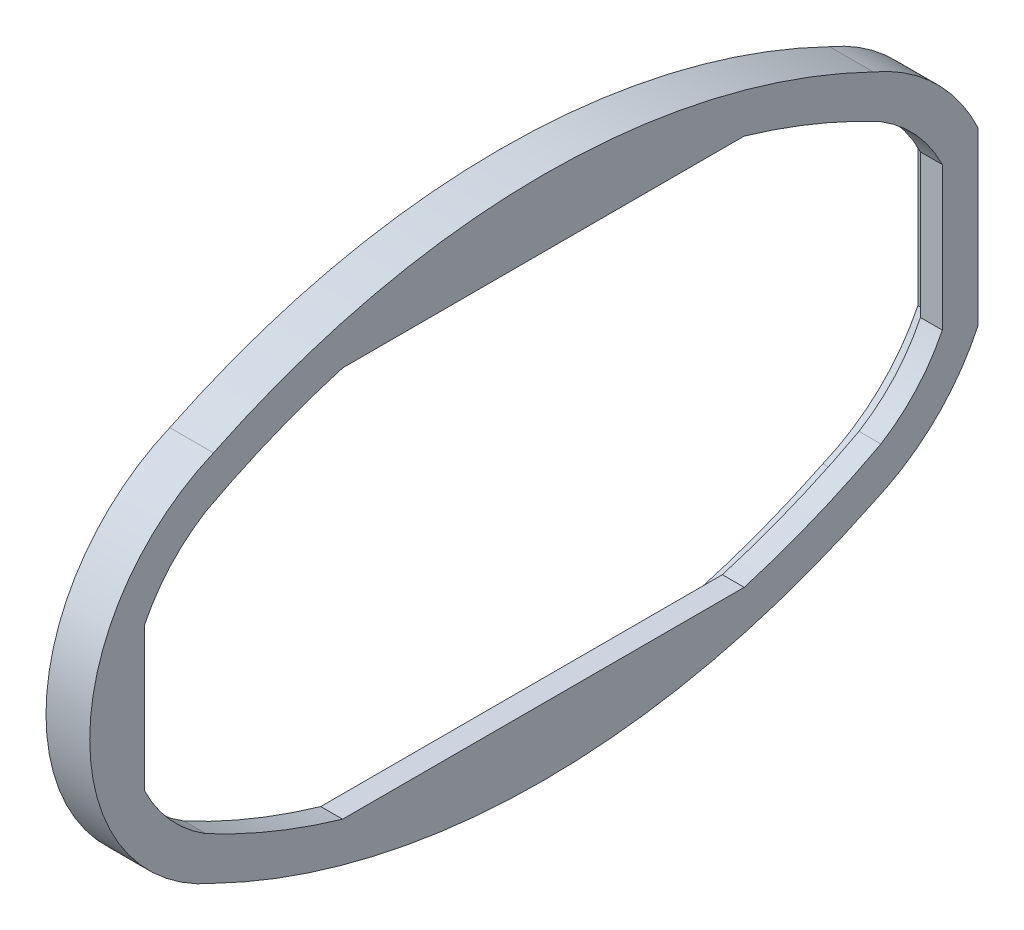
ISO-10303-21;
HEADER;
FILE_DESCRIPTION(('STEP AP214'),'2;1');
FILE_NAME('part.step','',(''),(''),'','','');
FILE_SCHEMA(('AUTOMOTIVE_DESIGN { 1 0 10303 214 1 1 1 1 }'));
ENDSEC;
DATA;
#1=APPLICATION_CONTEXT('core data for automotive mechanical design processes');
#2=APPLICATION_PROTOCOL_DEFINITION('international standard','automotive_design',2000,#1);
#3=PRODUCT_CONTEXT('',#1,'mechanical');
#4=PRODUCT('Part','Part','',(#3));
#5=PRODUCT_RELATED_PRODUCT_CATEGORY('part','',(#4));
#6=PRODUCT_DEFINITION_FORMATION('','',#4);
#7=PRODUCT_DEFINITION_CONTEXT('part definition',#1,'design');
#8=PRODUCT_DEFINITION('design','',#6,#7);
#9=PRODUCT_DEFINITION_SHAPE('','',#8);
#10=(LENGTH_UNIT() NAMED_UNIT(*) SI_UNIT(.MILLI.,.METRE.));
#11=(NAMED_UNIT(*) PLANE_ANGLE_UNIT() SI_UNIT($,.RADIAN.));
#12=(NAMED_UNIT(*) SI_UNIT($,.STERADIAN.) SOLID_ANGLE_UNIT());
#13=UNCERTAINTY_MEASURE_WITH_UNIT(LENGTH_MEASURE(1.E-05),#10,'distance_accuracy_value','');
#14=(GEOMETRIC_REPRESENTATION_CONTEXT(3) GLOBAL_UNCERTAINTY_ASSIGNED_CONTEXT((#13)) GLOBAL_UNIT_ASSIGNED_CONTEXT((#10,
#11,#12)) REPRESENTATION_CONTEXT('',''));
#15=CARTESIAN_POINT('',(0.,0.,0.));
#16=DIRECTION('',(0.,0.,1.));
#17=DIRECTION('',(1.,0.,0.));
#18=AXIS2_PLACEMENT_3D('',#15,#16,#17);
#19=CARTESIAN_POINT('',(0.,45.,0.));
#20=DIRECTION('',(-1.,0.,0.));
#21=DIRECTION('',(0.,0.,1.));
#22=AXIS2_PLACEMENT_3D('',#19,#20,#21);
#23=PLANE('',#22);
#24=CARTESIAN_POINT('',(0.,45.,0.));
#25=DIRECTION('',(1.,0.,0.));
#26=DIRECTION('',(0.,0.,-1.));
#27=AXIS2_PLACEMENT_3D('',#24,#25,#26);
#28=CIRCLE('',#27,69.);
#29=CARTESIAN_POINT('',(0.,-17.0507428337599,30.1778944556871));
#30=VERTEX_POINT('',#29);
#31=CARTESIAN_POINT('',(0.,-17.0507428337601,-30.1778944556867));
#32=VERTEX_POINT('',#31);
#33=EDGE_CURVE('E50',#30,#32,#28,.T.);
#34=ORIENTED_EDGE('',*,*,#33,.F.);
#35=CARTESIAN_POINT('',(0.,0.,23.));
#36=DIRECTION('',(1.,0.,0.));
#37=DIRECTION('',(0.,0.,1.));
#38=AXIS2_PLACEMENT_3D('',#35,#36,#37);
#39=CIRCLE('',#38,18.5);
#40=CARTESIAN_POINT('',(0.,17.0507428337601,30.1778944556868));
#41=VERTEX_POINT('',#40);
#42=EDGE_CURVE('E374',#41,#30,#39,.T.);
#43=ORIENTED_EDGE('',*,*,#42,.F.);
#44=CARTESIAN_POINT('',(0.,-45.,0.));
#45=DIRECTION('',(1.,0.,0.));
#46=DIRECTION('',(0.,0.,-1.));
#47=AXIS2_PLACEMENT_3D('',#44,#45,#46);
#48=CIRCLE('',#47,69.);
#49=CARTESIAN_POINT('',(0.,17.0507428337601,-30.1778944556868));
#50=VERTEX_POINT('',#49);
#51=EDGE_CURVE('E372',#50,#41,#48,.T.);
#52=ORIENTED_EDGE('',*,*,#51,.F.);
#53=CARTESIAN_POINT('',(0.,0.,-23.));
#54=DIRECTION('',(1.,0.,0.));
#55=DIRECTION('',(0.,0.,-1.));
#56=AXIS2_PLACEMENT_3D('',#53,#54,#55);
#57=CIRCLE('',#56,18.5);
#58=CARTESIAN_POINT('',(0.,7.84101786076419,-39.7561463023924));
#59=VERTEX_POINT('',#58);
#60=EDGE_CURVE('E369',#59,#50,#57,.T.);
#61=ORIENTED_EDGE('',*,*,#60,.F.);
#62=DIRECTION('',(0.,1.,0.));
#63=VECTOR('',#62,1.);
#64=CARTESIAN_POINT('',(0.,7.84101786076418,-39.7561463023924));
#65=LINE('',#64,#63);
#66=CARTESIAN_POINT('',(0.,-7.84101786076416,-39.7561463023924));
#67=VERTEX_POINT('',#66);
#68=EDGE_CURVE('E367',#67,#59,#65,.T.);
#69=ORIENTED_EDGE('',*,*,#68,.F.);
#70=CARTESIAN_POINT('',(0.,0.,-23.));
#71=DIRECTION('',(1.,0.,0.));
#72=DIRECTION('',(0.,0.,-1.));
#73=AXIS2_PLACEMENT_3D('',#70,#71,#72);
#74=CIRCLE('',#73,18.5);
#75=EDGE_CURVE('E365',#32,#67,#74,.T.);
#76=ORIENTED_EDGE('',*,*,#75,.F.);
#77=EDGE_LOOP('',(#34,#43,#52,#61,#69,#76));
#78=FACE_BOUND('',#77,.T.);
#79=CARTESIAN_POINT('',(0.,-45.,0.));
#80=DIRECTION('',(1.,0.,0.));
#81=DIRECTION('',(0.,0.,-1.));
#82=AXIS2_PLACEMENT_3D('',#79,#80,#81);
#83=CIRCLE('',#82,67.5);
#84=CARTESIAN_POINT('',(0.,15.6837381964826,-29.5589904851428));
#85=VERTEX_POINT('',#84);
#86=CARTESIAN_POINT('',(0.,15.6837381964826,29.5589904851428));
#87=VERTEX_POINT('',#86);
#88=EDGE_CURVE('E330',#85,#87,#83,.T.);
#89=ORIENTED_EDGE('',*,*,#88,.T.);
#90=CARTESIAN_POINT('',(0.,0.,23.));
#91=DIRECTION('',(1.,0.,0.));
#92=DIRECTION('',(0.,0.,1.));
#93=AXIS2_PLACEMENT_3D('',#90,#91,#92);
#94=CIRCLE('',#93,17.);
#95=CARTESIAN_POINT('',(0.,-15.6837381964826,29.5589904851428));
#96=VERTEX_POINT('',#95);
#97=EDGE_CURVE('E42',#87,#96,#94,.T.);
#98=ORIENTED_EDGE('',*,*,#97,.T.);
#99=CARTESIAN_POINT('',(0.,45.,0.));
#100=DIRECTION('',(1.,0.,0.));
#101=DIRECTION('',(0.,0.,-1.));
#102=AXIS2_PLACEMENT_3D('',#99,#100,#101);
#103=CIRCLE('',#102,67.5);
#104=CARTESIAN_POINT('',(0.,-15.6837381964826,-29.5589904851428));
#105=VERTEX_POINT('',#104);
#106=EDGE_CURVE('E318',#96,#105,#103,.T.);
#107=ORIENTED_EDGE('',*,*,#106,.T.);
#108=CARTESIAN_POINT('',(0.,0.,-23.));
#109=DIRECTION('',(1.,0.,0.));
#110=DIRECTION('',(0.,0.,-1.));
#111=AXIS2_PLACEMENT_3D('',#108,#109,#110);
#112=CIRCLE('',#111,17.);
#113=CARTESIAN_POINT('',(0.,-7.5,-38.2561463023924));
#114=VERTEX_POINT('',#113);
#115=EDGE_CURVE('E321',#105,#114,#112,.T.);
#116=ORIENTED_EDGE('',*,*,#115,.T.);
#117=DIRECTION('',(0.,1.,0.));
#118=VECTOR('',#117,1.);
#119=CARTESIAN_POINT('',(0.,7.5,-38.2561463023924));
#120=LINE('',#119,#118);
#121=CARTESIAN_POINT('',(0.,7.5,-38.2561463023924));
#122=VERTEX_POINT('',#121);
#123=EDGE_CURVE('E324',#114,#122,#120,.T.);
#124=ORIENTED_EDGE('',*,*,#123,.T.);
#125=CARTESIAN_POINT('',(0.,0.,-23.));
#126=DIRECTION('',(1.,0.,0.));
#127=DIRECTION('',(0.,0.,-1.));
#128=AXIS2_PLACEMENT_3D('',#125,#126,#127);
#129=CIRCLE('',#128,17.);
#130=EDGE_CURVE('E327',#122,#85,#129,.T.);
#131=ORIENTED_EDGE('',*,*,#130,.T.);
#132=EDGE_LOOP('',(#89,#98,#107,#116,#124,#131));
#133=FACE_BOUND('',#132,.T.);
#134=ADVANCED_FACE('F27',(#78,#133),#23,.T.);
#135=CARTESIAN_POINT('',(2.,45.,0.));
#136=DIRECTION('',(-1.,0.,0.));
#137=DIRECTION('',(0.,0.,1.));
#138=AXIS2_PLACEMENT_3D('',#135,#136,#137);
#139=CYLINDRICAL_SURFACE('',#138,69.);
#140=ORIENTED_EDGE('',*,*,#33,.T.);
#141=DIRECTION('',(-1.,0.,0.));
#142=VECTOR('',#141,1.);
#143=CARTESIAN_POINT('',(2.,-17.0507428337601,-30.1778944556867));
#144=LINE('',#143,#142);
#145=CARTESIAN_POINT('',(4.,-17.0507428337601,-30.1778944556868));
#146=VERTEX_POINT('',#145);
#147=EDGE_CURVE('E11',#146,#32,#144,.T.);
#148=ORIENTED_EDGE('',*,*,#147,.F.);
#149=CARTESIAN_POINT('',(4.,45.0000000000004,0.));
#150=DIRECTION('',(1.,0.,0.));
#151=DIRECTION('',(0.,0.,-1.));
#152=AXIS2_PLACEMENT_3D('',#149,#150,#151);
#153=CIRCLE('',#152,69.0000000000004);
#154=CARTESIAN_POINT('',(4.,-17.0507428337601,30.1778944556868));
#155=VERTEX_POINT('',#154);
#156=EDGE_CURVE('E302',#155,#146,#153,.T.);
#157=ORIENTED_EDGE('',*,*,#156,.F.);
#158=DIRECTION('',(-1.,0.,0.));
#159=VECTOR('',#158,1.);
#160=CARTESIAN_POINT('',(2.,-17.0507428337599,30.1778944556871));
#161=LINE('',#160,#159);
#162=EDGE_CURVE('E376',#155,#30,#161,.T.);
#163=ORIENTED_EDGE('',*,*,#162,.T.);
#164=EDGE_LOOP('',(#140,#148,#157,#163));
#165=FACE_BOUND('',#164,.T.);
#166=ADVANCED_FACE('F29',(#165),#139,.T.);
#167=CARTESIAN_POINT('',(2.,0.,-23.));
#168=DIRECTION('',(-1.,0.,0.));
#169=DIRECTION('',(0.,0.,1.));
#170=AXIS2_PLACEMENT_3D('',#167,#168,#169);
#171=CYLINDRICAL_SURFACE('',#170,18.5);
#172=ORIENTED_EDGE('',*,*,#75,.T.);
#173=DIRECTION('',(-1.,0.,0.));
#174=VECTOR('',#173,1.);
#175=CARTESIAN_POINT('',(2.,-7.84101786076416,-39.7561463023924));
#176=LINE('',#175,#174);
#177=CARTESIAN_POINT('',(4.,-7.84101786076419,-39.7561463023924));
#178=VERTEX_POINT('',#177);
#179=EDGE_CURVE('E35',#178,#67,#176,.T.);
#180=ORIENTED_EDGE('',*,*,#179,.F.);
#181=CARTESIAN_POINT('',(4.,0.,-23.0000000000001));
#182=DIRECTION('',(1.,0.,0.));
#183=DIRECTION('',(0.,0.,-1.));
#184=AXIS2_PLACEMENT_3D('',#181,#182,#183);
#185=CIRCLE('',#184,18.5);
#186=EDGE_CURVE('E305',#146,#178,#185,.T.);
#187=ORIENTED_EDGE('',*,*,#186,.F.);
#188=ORIENTED_EDGE('',*,*,#147,.T.);
#189=EDGE_LOOP('',(#172,#180,#187,#188));
#190=FACE_BOUND('',#189,.T.);
#191=ADVANCED_FACE('F407',(#190),#171,.T.);
#192=CARTESIAN_POINT('',(2.,7.84101786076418,-39.7561463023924));
#193=DIRECTION('',(0.,0.,1.));
#194=DIRECTION('',(1.,0.,0.));
#195=AXIS2_PLACEMENT_3D('',#192,#193,#194);
#196=PLANE('',#195);
#197=ORIENTED_EDGE('',*,*,#68,.T.);
#198=DIRECTION('',(-1.,0.,0.));
#199=VECTOR('',#198,1.);
#200=CARTESIAN_POINT('',(2.,7.84101786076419,-39.7561463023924));
#201=LINE('',#200,#199);
#202=CARTESIAN_POINT('',(4.,7.84101786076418,-39.7561463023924));
#203=VERTEX_POINT('',#202);
#204=EDGE_CURVE('E385',#203,#59,#201,.T.);
#205=ORIENTED_EDGE('',*,*,#204,.F.);
#206=DIRECTION('',(0.,1.,0.));
#207=VECTOR('',#206,1.);
#208=CARTESIAN_POINT('',(4.,7.84101786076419,-39.7561463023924));
#209=LINE('',#208,#207);
#210=EDGE_CURVE('E308',#178,#203,#209,.T.);
#211=ORIENTED_EDGE('',*,*,#210,.F.);
#212=ORIENTED_EDGE('',*,*,#179,.T.);
#213=EDGE_LOOP('',(#197,#205,#211,#212));
#214=FACE_BOUND('',#213,.T.);
#215=ADVANCED_FACE('F391',(#214),#196,.F.);
#216=CARTESIAN_POINT('',(2.,0.,-23.));
#217=DIRECTION('',(-1.,0.,0.));
#218=DIRECTION('',(0.,0.,1.));
#219=AXIS2_PLACEMENT_3D('',#216,#217,#218);
#220=CYLINDRICAL_SURFACE('',#219,18.5);
#221=ORIENTED_EDGE('',*,*,#60,.T.);
#222=DIRECTION('',(-1.,0.,0.));
#223=VECTOR('',#222,1.);
#224=CARTESIAN_POINT('',(2.,17.0507428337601,-30.1778944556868));
#225=LINE('',#224,#223);
#226=CARTESIAN_POINT('',(4.,17.0507428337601,-30.1778944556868));
#227=VERTEX_POINT('',#226);
#228=EDGE_CURVE('E382',#227,#50,#225,.T.);
#229=ORIENTED_EDGE('',*,*,#228,.F.);
#230=CARTESIAN_POINT('',(4.,0.,-23.0000000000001));
#231=DIRECTION('',(1.,0.,0.));
#232=DIRECTION('',(0.,0.,1.));
#233=AXIS2_PLACEMENT_3D('',#230,#231,#232);
#234=CIRCLE('',#233,18.4999999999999);
#235=EDGE_CURVE('E311',#203,#227,#234,.T.);
#236=ORIENTED_EDGE('',*,*,#235,.F.);
#237=ORIENTED_EDGE('',*,*,#204,.T.);
#238=EDGE_LOOP('',(#221,#229,#236,#237));
#239=FACE_BOUND('',#238,.T.);
#240=ADVANCED_FACE('F397',(#239),#220,.T.);
#241=CARTESIAN_POINT('',(2.,-45.,0.));
#242=DIRECTION('',(-1.,0.,0.));
#243=DIRECTION('',(0.,0.,1.));
#244=AXIS2_PLACEMENT_3D('',#241,#242,#243);
#245=CYLINDRICAL_SURFACE('',#244,69.);
#246=ORIENTED_EDGE('',*,*,#51,.T.);
#247=DIRECTION('',(-1.,0.,0.));
#248=VECTOR('',#247,1.);
#249=CARTESIAN_POINT('',(2.,17.0507428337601,30.1778944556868));
#250=LINE('',#249,#248);
#251=CARTESIAN_POINT('',(4.,17.0507428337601,30.1778944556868));
#252=VERTEX_POINT('',#251);
#253=EDGE_CURVE('E379',#252,#41,#250,.T.);
#254=ORIENTED_EDGE('',*,*,#253,.F.);
#255=CARTESIAN_POINT('',(4.,-45.0000000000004,0.));
#256=DIRECTION('',(1.,0.,0.));
#257=DIRECTION('',(0.,0.,1.));
#258=AXIS2_PLACEMENT_3D('',#255,#256,#257);
#259=CIRCLE('',#258,69.0000000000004);
#260=EDGE_CURVE('E314',#227,#252,#259,.T.);
#261=ORIENTED_EDGE('',*,*,#260,.F.);
#262=ORIENTED_EDGE('',*,*,#228,.T.);
#263=EDGE_LOOP('',(#246,#254,#261,#262));
#264=FACE_BOUND('',#263,.T.);
#265=ADVANCED_FACE('F401',(#264),#245,.T.);
#266=CARTESIAN_POINT('',(2.,0.,23.));
#267=DIRECTION('',(-1.,0.,0.));
#268=DIRECTION('',(0.,0.,1.));
#269=AXIS2_PLACEMENT_3D('',#266,#267,#268);
#270=CYLINDRICAL_SURFACE('',#269,18.5);
#271=ORIENTED_EDGE('',*,*,#42,.T.);
#272=ORIENTED_EDGE('',*,*,#162,.F.);
#273=CARTESIAN_POINT('',(4.,0.,22.9999999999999));
#274=DIRECTION('',(1.,0.,0.));
#275=DIRECTION('',(0.,0.,-1.));
#276=AXIS2_PLACEMENT_3D('',#273,#274,#275);
#277=CIRCLE('',#276,18.5);
#278=EDGE_CURVE('E299',#252,#155,#277,.T.);
#279=ORIENTED_EDGE('',*,*,#278,.F.);
#280=ORIENTED_EDGE('',*,*,#253,.T.);
#281=EDGE_LOOP('',(#271,#272,#279,#280));
#282=FACE_BOUND('',#281,.T.);
#283=ADVANCED_FACE('F404',(#282),#270,.T.);
#284=CARTESIAN_POINT('',(2.,0.,23.));
#285=DIRECTION('',(-1.,0.,0.));
#286=DIRECTION('',(0.,0.,1.));
#287=AXIS2_PLACEMENT_3D('',#284,#285,#286);
#288=CYLINDRICAL_SURFACE('',#287,17.);
#289=ORIENTED_EDGE('',*,*,#97,.F.);
#290=DIRECTION('',(-1.,0.,0.));
#291=VECTOR('',#290,1.);
#292=CARTESIAN_POINT('',(2.,15.6837381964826,29.5589904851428));
#293=LINE('',#292,#291);
#294=CARTESIAN_POINT('',(2.,15.6837381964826,29.5589904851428));
#295=VERTEX_POINT('',#294);
#296=EDGE_CURVE('E351',#295,#87,#293,.T.);
#297=ORIENTED_EDGE('',*,*,#296,.F.);
#298=CARTESIAN_POINT('',(2.,0.,23.));
#299=DIRECTION('',(1.,0.,0.));
#300=DIRECTION('',(0.,0.,1.));
#301=AXIS2_PLACEMENT_3D('',#298,#299,#300);
#302=CIRCLE('',#301,17.);
#303=CARTESIAN_POINT('',(2.,-15.6837381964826,29.5589904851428));
#304=VERTEX_POINT('',#303);
#305=EDGE_CURVE('E333',#295,#304,#302,.T.);
#306=ORIENTED_EDGE('',*,*,#305,.T.);
#307=DIRECTION('',(-1.,0.,0.));
#308=VECTOR('',#307,1.);
#309=CARTESIAN_POINT('',(2.,-15.6837381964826,29.5589904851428));
#310=LINE('',#309,#308);
#311=EDGE_CURVE('E362',#304,#96,#310,.T.);
#312=ORIENTED_EDGE('',*,*,#311,.T.);
#313=EDGE_LOOP('',(#289,#297,#306,#312));
#314=FACE_BOUND('',#313,.T.);
#315=ADVANCED_FACE('F420',(#314),#288,.F.);
#316=CARTESIAN_POINT('',(2.,45.,0.));
#317=DIRECTION('',(-1.,0.,0.));
#318=DIRECTION('',(0.,0.,1.));
#319=AXIS2_PLACEMENT_3D('',#316,#317,#318);
#320=CYLINDRICAL_SURFACE('',#319,67.5);
#321=ORIENTED_EDGE('',*,*,#106,.F.);
#322=ORIENTED_EDGE('',*,*,#311,.F.);
#323=CARTESIAN_POINT('',(2.,45.,0.));
#324=DIRECTION('',(1.,0.,0.));
#325=DIRECTION('',(0.,0.,1.));
#326=AXIS2_PLACEMENT_3D('',#323,#324,#325);
#327=CIRCLE('',#326,67.5);
#328=CARTESIAN_POINT('',(2.,-15.6837381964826,-29.5589904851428));
#329=VERTEX_POINT('',#328);
#330=EDGE_CURVE('E336',#304,#329,#327,.T.);
#331=ORIENTED_EDGE('',*,*,#330,.T.);
#332=DIRECTION('',(-1.,0.,0.));
#333=VECTOR('',#332,1.);
#334=CARTESIAN_POINT('',(2.,-15.6837381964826,-29.5589904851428));
#335=LINE('',#334,#333);
#336=EDGE_CURVE('E360',#329,#105,#335,.T.);
#337=ORIENTED_EDGE('',*,*,#336,.T.);
#338=EDGE_LOOP('',(#321,#322,#331,#337));
#339=FACE_BOUND('',#338,.T.);
#340=ADVANCED_FACE('F449',(#339),#320,.F.);
#341=CARTESIAN_POINT('',(2.,0.,-23.));
#342=DIRECTION('',(-1.,0.,0.));
#343=DIRECTION('',(0.,0.,1.));
#344=AXIS2_PLACEMENT_3D('',#341,#342,#343);
#345=CYLINDRICAL_SURFACE('',#344,17.);
#346=ORIENTED_EDGE('',*,*,#115,.F.);
#347=ORIENTED_EDGE('',*,*,#336,.F.);
#348=CARTESIAN_POINT('',(2.,0.,-23.));
#349=DIRECTION('',(1.,0.,0.));
#350=DIRECTION('',(0.,0.,-1.));
#351=AXIS2_PLACEMENT_3D('',#348,#349,#350);
#352=CIRCLE('',#351,17.);
#353=CARTESIAN_POINT('',(2.,-7.5,-38.2561463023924));
#354=VERTEX_POINT('',#353);
#355=EDGE_CURVE('E339',#329,#354,#352,.T.);
#356=ORIENTED_EDGE('',*,*,#355,.T.);
#357=DIRECTION('',(-1.,0.,0.));
#358=VECTOR('',#357,1.);
#359=CARTESIAN_POINT('',(2.,-7.5,-38.2561463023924));
#360=LINE('',#359,#358);
#361=EDGE_CURVE('E358',#354,#114,#360,.T.);
#362=ORIENTED_EDGE('',*,*,#361,.T.);
#363=EDGE_LOOP('',(#346,#347,#356,#362));
#364=FACE_BOUND('',#363,.T.);
#365=ADVANCED_FACE('F456',(#364),#345,.F.);
#366=CARTESIAN_POINT('',(2.,7.5,-38.2561463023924));
#367=DIRECTION('',(0.,0.,1.));
#368=DIRECTION('',(1.,0.,0.));
#369=AXIS2_PLACEMENT_3D('',#366,#367,#368);
#370=PLANE('',#369);
#371=ORIENTED_EDGE('',*,*,#123,.F.);
#372=ORIENTED_EDGE('',*,*,#361,.F.);
#373=DIRECTION('',(0.,1.,0.));
#374=VECTOR('',#373,1.);
#375=CARTESIAN_POINT('',(2.,7.5,-38.2561463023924));
#376=LINE('',#375,#374);
#377=CARTESIAN_POINT('',(2.,7.5,-38.2561463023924));
#378=VERTEX_POINT('',#377);
#379=EDGE_CURVE('E342',#354,#378,#376,.T.);
#380=ORIENTED_EDGE('',*,*,#379,.T.);
#381=DIRECTION('',(-1.,0.,0.));
#382=VECTOR('',#381,1.);
#383=CARTESIAN_POINT('',(2.,7.5,-38.2561463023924));
#384=LINE('',#383,#382);
#385=EDGE_CURVE('E356',#378,#122,#384,.T.);
#386=ORIENTED_EDGE('',*,*,#385,.T.);
#387=EDGE_LOOP('',(#371,#372,#380,#386));
#388=FACE_BOUND('',#387,.T.);
#389=ADVANCED_FACE('F463',(#388),#370,.T.);
#390=CARTESIAN_POINT('',(2.,0.,-23.));
#391=DIRECTION('',(-1.,0.,0.));
#392=DIRECTION('',(0.,0.,1.));
#393=AXIS2_PLACEMENT_3D('',#390,#391,#392);
#394=CYLINDRICAL_SURFACE('',#393,17.);
#395=ORIENTED_EDGE('',*,*,#130,.F.);
#396=ORIENTED_EDGE('',*,*,#385,.F.);
#397=CARTESIAN_POINT('',(2.,0.,-23.));
#398=DIRECTION('',(1.,0.,0.));
#399=DIRECTION('',(0.,0.,-1.));
#400=AXIS2_PLACEMENT_3D('',#397,#398,#399);
#401=CIRCLE('',#400,17.);
#402=CARTESIAN_POINT('',(2.,15.6837381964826,-29.5589904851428));
#403=VERTEX_POINT('',#402);
#404=EDGE_CURVE('E345',#378,#403,#401,.T.);
#405=ORIENTED_EDGE('',*,*,#404,.T.);
#406=DIRECTION('',(-1.,0.,0.));
#407=VECTOR('',#406,1.);
#408=CARTESIAN_POINT('',(2.,15.6837381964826,-29.5589904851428));
#409=LINE('',#408,#407);
#410=EDGE_CURVE('E353',#403,#85,#409,.T.);
#411=ORIENTED_EDGE('',*,*,#410,.T.);
#412=EDGE_LOOP('',(#395,#396,#405,#411));
#413=FACE_BOUND('',#412,.T.);
#414=ADVANCED_FACE('F471',(#413),#394,.F.);
#415=CARTESIAN_POINT('',(2.,-45.,0.));
#416=DIRECTION('',(-1.,0.,0.));
#417=DIRECTION('',(0.,0.,1.));
#418=AXIS2_PLACEMENT_3D('',#415,#416,#417);
#419=CYLINDRICAL_SURFACE('',#418,67.5);
#420=ORIENTED_EDGE('',*,*,#88,.F.);
#421=ORIENTED_EDGE('',*,*,#410,.F.);
#422=CARTESIAN_POINT('',(2.,-45.,0.));
#423=DIRECTION('',(1.,0.,0.));
#424=DIRECTION('',(0.,0.,1.));
#425=AXIS2_PLACEMENT_3D('',#422,#423,#424);
#426=CIRCLE('',#425,67.5);
#427=EDGE_CURVE('E348',#403,#295,#426,.T.);
#428=ORIENTED_EDGE('',*,*,#427,.T.);
#429=ORIENTED_EDGE('',*,*,#296,.T.);
#430=EDGE_LOOP('',(#420,#421,#428,#429));
#431=FACE_BOUND('',#430,.T.);
#432=ADVANCED_FACE('F479',(#431),#419,.F.);
#433=CARTESIAN_POINT('',(2.,0.,22.9999999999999));
#434=DIRECTION('',(1.,0.,0.));
#435=DIRECTION('',(0.,0.,-1.));
#436=AXIS2_PLACEMENT_3D('',#433,#434,#435);
#437=PLANE('',#436);
#438=DIRECTION('',(0.,0.,1.));
#439=VECTOR('',#438,1.);
#440=CARTESIAN_POINT('',(2.,17.8718686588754,22.9999999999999));
#441=LINE('',#440,#439);
#442=CARTESIAN_POINT('',(2.,17.8718686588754,-18.3678559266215));
#443=VERTEX_POINT('',#442);
#444=CARTESIAN_POINT('',(2.,17.8718686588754,18.3678559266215));
#445=VERTEX_POINT('',#444);
#446=EDGE_CURVE('E255',#443,#445,#441,.T.);
#447=ORIENTED_EDGE('',*,*,#446,.T.);
#448=CARTESIAN_POINT('',(2.,-44.9999999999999,0.));
#449=DIRECTION('',(1.,0.,0.));
#450=DIRECTION('',(0.,0.,-1.));
#451=AXIS2_PLACEMENT_3D('',#448,#449,#450);
#452=CIRCLE('',#451,65.4999999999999);
#453=CARTESIAN_POINT('',(2.,12.7673112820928,30.8737387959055));
#454=VERTEX_POINT('',#453);
#455=EDGE_CURVE('E284',#445,#454,#452,.T.);
#456=ORIENTED_EDGE('',*,*,#455,.T.);
#457=CARTESIAN_POINT('',(2.,3.33066907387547E-13,23.));
#458=DIRECTION('',(1.,0.,0.));
#459=DIRECTION('',(0.,0.,-1.));
#460=AXIS2_PLACEMENT_3D('',#457,#458,#459);
#461=CIRCLE('',#460,14.9999999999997);
#462=CARTESIAN_POINT('',(2.,6.55817192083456,36.4903810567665));
#463=VERTEX_POINT('',#462);
#464=EDGE_CURVE('E287',#454,#463,#461,.T.);
#465=ORIENTED_EDGE('',*,*,#464,.T.);
#466=DIRECTION('',(0.,-1.,0.));
#467=VECTOR('',#466,1.);
#468=CARTESIAN_POINT('',(2.,0.,36.4903810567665));
#469=LINE('',#468,#467);
#470=CARTESIAN_POINT('',(2.,-6.55817192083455,36.4903810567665));
#471=VERTEX_POINT('',#470);
#472=EDGE_CURVE('E210',#463,#471,#469,.T.);
#473=ORIENTED_EDGE('',*,*,#472,.T.);
#474=CARTESIAN_POINT('',(2.,3.38271077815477E-13,22.9999999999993));
#475=DIRECTION('',(1.,0.,0.));
#476=DIRECTION('',(0.,0.,-1.));
#477=AXIS2_PLACEMENT_3D('',#474,#475,#476);
#478=CIRCLE('',#477,15.0000000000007);
#479=CARTESIAN_POINT('',(2.,-12.7673112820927,30.8737387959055));
#480=VERTEX_POINT('',#479);
#481=EDGE_CURVE('E289',#471,#480,#478,.T.);
#482=ORIENTED_EDGE('',*,*,#481,.T.);
#483=CARTESIAN_POINT('',(2.,45.0000000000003,0.));
#484=DIRECTION('',(1.,0.,0.));
#485=DIRECTION('',(0.,0.,-1.));
#486=AXIS2_PLACEMENT_3D('',#483,#484,#485);
#487=CIRCLE('',#486,65.5000000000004);
#488=CARTESIAN_POINT('',(2.,-17.8718686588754,18.3678559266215));
#489=VERTEX_POINT('',#488);
#490=EDGE_CURVE('E292',#480,#489,#487,.T.);
#491=ORIENTED_EDGE('',*,*,#490,.T.);
#492=DIRECTION('',(0.,0.,-1.));
#493=VECTOR('',#492,1.);
#494=CARTESIAN_POINT('',(2.,-17.8718686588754,22.9999999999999));
#495=LINE('',#494,#493);
#496=CARTESIAN_POINT('',(2.,-17.8718686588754,-18.3678559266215));
#497=VERTEX_POINT('',#496);
#498=EDGE_CURVE('E249',#489,#497,#495,.T.);
#499=ORIENTED_EDGE('',*,*,#498,.T.);
#500=CARTESIAN_POINT('',(2.,45.0000000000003,0.));
#501=DIRECTION('',(1.,0.,0.));
#502=DIRECTION('',(0.,0.,-1.));
#503=AXIS2_PLACEMENT_3D('',#500,#501,#502);
#504=CIRCLE('',#503,65.5000000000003);
#505=CARTESIAN_POINT('',(2.,-12.7673112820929,-30.8737387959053));
#506=VERTEX_POINT('',#505);
#507=EDGE_CURVE('E294',#497,#506,#504,.T.);
#508=ORIENTED_EDGE('',*,*,#507,.T.);
#509=CARTESIAN_POINT('',(2.,0.,-23.));
#510=DIRECTION('',(1.,0.,0.));
#511=DIRECTION('',(0.,0.,-1.));
#512=AXIS2_PLACEMENT_3D('',#509,#510,#511);
#513=CIRCLE('',#512,15.0000000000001);
#514=CARTESIAN_POINT('',(2.,-6.55817192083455,-36.4903810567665));
#515=VERTEX_POINT('',#514);
#516=EDGE_CURVE('E297',#506,#515,#513,.T.);
#517=ORIENTED_EDGE('',*,*,#516,.T.);
#518=DIRECTION('',(0.,1.,0.));
#519=VECTOR('',#518,1.);
#520=CARTESIAN_POINT('',(2.,0.,-36.4903810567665));
#521=LINE('',#520,#519);
#522=CARTESIAN_POINT('',(2.,6.55817192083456,-36.4903810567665));
#523=VERTEX_POINT('',#522);
#524=EDGE_CURVE('E252',#515,#523,#521,.T.);
#525=ORIENTED_EDGE('',*,*,#524,.T.);
#526=CARTESIAN_POINT('',(2.,-1.31838984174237E-13,-22.9999999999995));
#527=DIRECTION('',(1.,0.,0.));
#528=DIRECTION('',(0.,0.,-1.));
#529=AXIS2_PLACEMENT_3D('',#526,#527,#528);
#530=CIRCLE('',#529,15.0000000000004);
#531=CARTESIAN_POINT('',(2.,12.7673112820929,-30.8737387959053));
#532=VERTEX_POINT('',#531);
#533=EDGE_CURVE('E275',#523,#532,#530,.T.);
#534=ORIENTED_EDGE('',*,*,#533,.T.);
#535=CARTESIAN_POINT('',(2.,-44.9999999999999,0.));
#536=DIRECTION('',(1.,0.,0.));
#537=DIRECTION('',(0.,0.,-1.));
#538=AXIS2_PLACEMENT_3D('',#535,#536,#537);
#539=CIRCLE('',#538,65.4999999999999);
#540=EDGE_CURVE('E282',#532,#443,#539,.T.);
#541=ORIENTED_EDGE('',*,*,#540,.T.);
#542=EDGE_LOOP('',(#447,#456,#465,#473,#482,#491,#499,#508,#517,#525,#534,#541));
#543=FACE_BOUND('',#542,.T.);
#544=ORIENTED_EDGE('',*,*,#305,.F.);
#545=ORIENTED_EDGE('',*,*,#427,.F.);
#546=ORIENTED_EDGE('',*,*,#404,.F.);
#547=ORIENTED_EDGE('',*,*,#379,.F.);
#548=ORIENTED_EDGE('',*,*,#355,.F.);
#549=ORIENTED_EDGE('',*,*,#330,.F.);
#550=EDGE_LOOP('',(#544,#545,#546,#547,#548,#549));
#551=FACE_BOUND('',#550,.T.);
#552=ADVANCED_FACE('F488',(#543,#551),#437,.F.);
#553=CARTESIAN_POINT('',(4.,0.,22.9999999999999));
#554=DIRECTION('',(1.,0.,0.));
#555=DIRECTION('',(0.,0.,-1.));
#556=AXIS2_PLACEMENT_3D('',#553,#554,#555);
#557=PLANE('',#556);
#558=CARTESIAN_POINT('',(4.,-44.9999999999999,0.));
#559=DIRECTION('',(1.,0.,0.));
#560=DIRECTION('',(0.,0.,-1.));
#561=AXIS2_PLACEMENT_3D('',#558,#559,#560);
#562=CIRCLE('',#561,65.4999999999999);
#563=CARTESIAN_POINT('',(4.,17.8718686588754,18.3678559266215));
#564=VERTEX_POINT('',#563);
#565=CARTESIAN_POINT('',(4.,12.7673112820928,30.8737387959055));
#566=VERTEX_POINT('',#565);
#567=EDGE_CURVE('E201',#564,#566,#562,.T.);
#568=ORIENTED_EDGE('',*,*,#567,.F.);
#569=DIRECTION('',(0.,0.,1.));
#570=VECTOR('',#569,1.);
#571=CARTESIAN_POINT('',(4.,17.8718686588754,-18.3678559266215));
#572=LINE('',#571,#570);
#573=CARTESIAN_POINT('',(4.,17.8718686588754,-18.3678559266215));
#574=VERTEX_POINT('',#573);
#575=EDGE_CURVE('E212',#574,#564,#572,.T.);
#576=ORIENTED_EDGE('',*,*,#575,.F.);
#577=CARTESIAN_POINT('',(4.,-44.9999999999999,0.));
#578=DIRECTION('',(1.,0.,0.));
#579=DIRECTION('',(0.,0.,-1.));
#580=AXIS2_PLACEMENT_3D('',#577,#578,#579);
#581=CIRCLE('',#580,65.4999999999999);
#582=CARTESIAN_POINT('',(4.,12.7673112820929,-30.8737387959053));
#583=VERTEX_POINT('',#582);
#584=EDGE_CURVE('E263',#583,#574,#581,.T.);
#585=ORIENTED_EDGE('',*,*,#584,.F.);
#586=CARTESIAN_POINT('',(4.,-1.31838984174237E-13,-22.9999999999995));
#587=DIRECTION('',(1.,0.,0.));
#588=DIRECTION('',(0.,0.,-1.));
#589=AXIS2_PLACEMENT_3D('',#586,#587,#588);
#590=CIRCLE('',#589,15.0000000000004);
#591=CARTESIAN_POINT('',(4.,6.55817192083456,-36.4903810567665));
#592=VERTEX_POINT('',#591);
#593=EDGE_CURVE('E260',#592,#583,#590,.T.);
#594=ORIENTED_EDGE('',*,*,#593,.F.);
#595=DIRECTION('',(0.,1.,0.));
#596=VECTOR('',#595,1.);
#597=CARTESIAN_POINT('',(4.,6.55817192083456,-36.4903810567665));
#598=LINE('',#597,#596);
#599=CARTESIAN_POINT('',(4.,-6.55817192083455,-36.4903810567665));
#600=VERTEX_POINT('',#599);
#601=EDGE_CURVE('E222',#600,#592,#598,.T.);
#602=ORIENTED_EDGE('',*,*,#601,.F.);
#603=CARTESIAN_POINT('',(4.,0.,-23.));
#604=DIRECTION('',(1.,0.,0.));
#605=DIRECTION('',(0.,0.,1.));
#606=AXIS2_PLACEMENT_3D('',#603,#604,#605);
#607=CIRCLE('',#606,15.0000000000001);
#608=CARTESIAN_POINT('',(4.,-12.7673112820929,-30.8737387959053));
#609=VERTEX_POINT('',#608);
#610=EDGE_CURVE('E258',#609,#600,#607,.T.);
#611=ORIENTED_EDGE('',*,*,#610,.F.);
#612=CARTESIAN_POINT('',(4.,45.0000000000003,0.));
#613=DIRECTION('',(1.,0.,0.));
#614=DIRECTION('',(0.,0.,-1.));
#615=AXIS2_PLACEMENT_3D('',#612,#613,#614);
#616=CIRCLE('',#615,65.5000000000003);
#617=CARTESIAN_POINT('',(4.,-17.8718686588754,-18.3678559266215));
#618=VERTEX_POINT('',#617);
#619=EDGE_CURVE('E269',#618,#609,#616,.T.);
#620=ORIENTED_EDGE('',*,*,#619,.F.);
#621=DIRECTION('',(0.,0.,-1.));
#622=VECTOR('',#621,1.);
#623=CARTESIAN_POINT('',(4.,-17.8718686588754,-18.3678559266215));
#624=LINE('',#623,#622);
#625=CARTESIAN_POINT('',(4.,-17.8718686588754,18.3678559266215));
#626=VERTEX_POINT('',#625);
#627=EDGE_CURVE('E219',#626,#618,#624,.T.);
#628=ORIENTED_EDGE('',*,*,#627,.F.);
#629=CARTESIAN_POINT('',(4.,45.0000000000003,0.));
#630=DIRECTION('',(1.,0.,0.));
#631=DIRECTION('',(0.,0.,-1.));
#632=AXIS2_PLACEMENT_3D('',#629,#630,#631);
#633=CIRCLE('',#632,65.5000000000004);
#634=CARTESIAN_POINT('',(4.,-12.7673112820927,30.8737387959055));
#635=VERTEX_POINT('',#634);
#636=EDGE_CURVE('E267',#635,#626,#633,.T.);
#637=ORIENTED_EDGE('',*,*,#636,.F.);
#638=CARTESIAN_POINT('',(4.,3.38271077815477E-13,22.9999999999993));
#639=DIRECTION('',(1.,0.,0.));
#640=DIRECTION('',(0.,0.,-1.));
#641=AXIS2_PLACEMENT_3D('',#638,#639,#640);
#642=CIRCLE('',#641,15.0000000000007);
#643=CARTESIAN_POINT('',(4.,-6.55817192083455,36.4903810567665));
#644=VERTEX_POINT('',#643);
#645=EDGE_CURVE('E200',#644,#635,#642,.T.);
#646=ORIENTED_EDGE('',*,*,#645,.F.);
#647=DIRECTION('',(0.,-1.,0.));
#648=VECTOR('',#647,1.);
#649=CARTESIAN_POINT('',(4.,6.55817192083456,36.4903810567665));
#650=LINE('',#649,#648);
#651=CARTESIAN_POINT('',(4.,6.55817192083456,36.4903810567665));
#652=VERTEX_POINT('',#651);
#653=EDGE_CURVE('E208',#652,#644,#650,.T.);
#654=ORIENTED_EDGE('',*,*,#653,.F.);
#655=CARTESIAN_POINT('',(4.,3.33066907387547E-13,23.));
#656=DIRECTION('',(1.,0.,0.));
#657=DIRECTION('',(0.,0.,-1.));
#658=AXIS2_PLACEMENT_3D('',#655,#656,#657);
#659=CIRCLE('',#658,14.9999999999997);
#660=EDGE_CURVE('E191',#566,#652,#659,.T.);
#661=ORIENTED_EDGE('',*,*,#660,.F.);
#662=EDGE_LOOP('',(#568,#576,#585,#594,#602,#611,#620,#628,#637,#646,#654,#661));
#663=FACE_BOUND('',#662,.T.);
#664=ORIENTED_EDGE('',*,*,#278,.T.);
#665=ORIENTED_EDGE('',*,*,#156,.T.);
#666=ORIENTED_EDGE('',*,*,#186,.T.);
#667=ORIENTED_EDGE('',*,*,#210,.T.);
#668=ORIENTED_EDGE('',*,*,#235,.T.);
#669=ORIENTED_EDGE('',*,*,#260,.T.);
#670=EDGE_LOOP('',(#664,#665,#666,#667,#668,#669));
#671=FACE_BOUND('',#670,.T.);
#672=ADVANCED_FACE('F214',(#663,#671),#557,.T.);
#673=CARTESIAN_POINT('',(0.,0.,-23.));
#674=DIRECTION('',(1.,0.,0.));
#675=DIRECTION('',(0.,0.,-1.));
#676=AXIS2_PLACEMENT_3D('',#673,#674,#675);
#677=CYLINDRICAL_SURFACE('',#676,15.0000000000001);
#678=DIRECTION('',(1.,0.,0.));
#679=VECTOR('',#678,1.);
#680=CARTESIAN_POINT('',(0.,-12.7673112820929,-30.8737387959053));
#681=LINE('',#680,#679);
#682=EDGE_CURVE('E273',#506,#609,#681,.T.);
#683=ORIENTED_EDGE('',*,*,#682,.T.);
#684=ORIENTED_EDGE('',*,*,#610,.T.);
#685=DIRECTION('',(1.,0.,0.));
#686=VECTOR('',#685,1.);
#687=CARTESIAN_POINT('',(0.,-6.55817192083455,-36.4903810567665));
#688=LINE('',#687,#686);
#689=EDGE_CURVE('E238',#515,#600,#688,.T.);
#690=ORIENTED_EDGE('',*,*,#689,.F.);
#691=ORIENTED_EDGE('',*,*,#516,.F.);
#692=EDGE_LOOP('',(#683,#684,#690,#691));
#693=FACE_BOUND('',#692,.T.);
#694=ADVANCED_FACE('F503',(#693),#677,.F.);
#695=CARTESIAN_POINT('',(0.,45.0000000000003,0.));
#696=DIRECTION('',(1.,0.,0.));
#697=DIRECTION('',(0.,0.,-1.));
#698=AXIS2_PLACEMENT_3D('',#695,#696,#697);
#699=CYLINDRICAL_SURFACE('',#698,65.5000000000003);
#700=ORIENTED_EDGE('',*,*,#507,.F.);
#701=DIRECTION('',(1.,0.,0.));
#702=VECTOR('',#701,1.);
#703=CARTESIAN_POINT('',(0.,-17.8718686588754,-18.3678559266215));
#704=LINE('',#703,#702);
#705=EDGE_CURVE('E241',#497,#618,#704,.T.);
#706=ORIENTED_EDGE('',*,*,#705,.T.);
#707=ORIENTED_EDGE('',*,*,#619,.T.);
#708=ORIENTED_EDGE('',*,*,#682,.F.);
#709=EDGE_LOOP('',(#700,#706,#707,#708));
#710=FACE_BOUND('',#709,.T.);
#711=ADVANCED_FACE('F511',(#710),#699,.F.);
#712=CARTESIAN_POINT('',(0.,45.0000000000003,0.));
#713=DIRECTION('',(1.,0.,0.));
#714=DIRECTION('',(0.,0.,-1.));
#715=AXIS2_PLACEMENT_3D('',#712,#713,#714);
#716=CYLINDRICAL_SURFACE('',#715,65.5000000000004);
#717=DIRECTION('',(1.,0.,0.));
#718=VECTOR('',#717,1.);
#719=CARTESIAN_POINT('',(0.,-12.7673112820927,30.8737387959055));
#720=LINE('',#719,#718);
#721=EDGE_CURVE('E276',#480,#635,#720,.T.);
#722=ORIENTED_EDGE('',*,*,#721,.T.);
#723=ORIENTED_EDGE('',*,*,#636,.T.);
#724=DIRECTION('',(1.,0.,0.));
#725=VECTOR('',#724,1.);
#726=CARTESIAN_POINT('',(0.,-17.8718686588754,18.3678559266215));
#727=LINE('',#726,#725);
#728=EDGE_CURVE('E244',#489,#626,#727,.T.);
#729=ORIENTED_EDGE('',*,*,#728,.F.);
#730=ORIENTED_EDGE('',*,*,#490,.F.);
#731=EDGE_LOOP('',(#722,#723,#729,#730));
#732=FACE_BOUND('',#731,.T.);
#733=ADVANCED_FACE('F520',(#732),#716,.F.);
#734=CARTESIAN_POINT('',(0.,3.38271077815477E-13,22.9999999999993));
#735=DIRECTION('',(1.,0.,0.));
#736=DIRECTION('',(0.,0.,-1.));
#737=AXIS2_PLACEMENT_3D('',#734,#735,#736);
#738=CYLINDRICAL_SURFACE('',#737,15.0000000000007);
#739=ORIENTED_EDGE('',*,*,#481,.F.);
#740=DIRECTION('',(1.,0.,0.));
#741=VECTOR('',#740,1.);
#742=CARTESIAN_POINT('',(0.,-6.55817192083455,36.4903810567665));
#743=LINE('',#742,#741);
#744=EDGE_CURVE('E211',#471,#644,#743,.T.);
#745=ORIENTED_EDGE('',*,*,#744,.T.);
#746=ORIENTED_EDGE('',*,*,#645,.T.);
#747=ORIENTED_EDGE('',*,*,#721,.F.);
#748=EDGE_LOOP('',(#739,#745,#746,#747));
#749=FACE_BOUND('',#748,.T.);
#750=ADVANCED_FACE('F529',(#749),#738,.F.);
#751=CARTESIAN_POINT('',(0.,3.33066907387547E-13,23.));
#752=DIRECTION('',(1.,0.,0.));
#753=DIRECTION('',(0.,0.,-1.));
#754=AXIS2_PLACEMENT_3D('',#751,#752,#753);
#755=CYLINDRICAL_SURFACE('',#754,14.9999999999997);
#756=DIRECTION('',(1.,0.,0.));
#757=VECTOR('',#756,1.);
#758=CARTESIAN_POINT('',(0.,12.7673112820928,30.8737387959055));
#759=LINE('',#758,#757);
#760=EDGE_CURVE('E196',#454,#566,#759,.T.);
#761=ORIENTED_EDGE('',*,*,#760,.T.);
#762=ORIENTED_EDGE('',*,*,#660,.T.);
#763=DIRECTION('',(1.,0.,0.));
#764=VECTOR('',#763,1.);
#765=CARTESIAN_POINT('',(0.,6.55817192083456,36.4903810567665));
#766=LINE('',#765,#764);
#767=EDGE_CURVE('E194',#463,#652,#766,.T.);
#768=ORIENTED_EDGE('',*,*,#767,.F.);
#769=ORIENTED_EDGE('',*,*,#464,.F.);
#770=EDGE_LOOP('',(#761,#762,#768,#769));
#771=FACE_BOUND('',#770,.T.);
#772=ADVANCED_FACE('F193',(#771),#755,.F.);
#773=CARTESIAN_POINT('',(0.,-44.9999999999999,0.));
#774=DIRECTION('',(1.,0.,0.));
#775=DIRECTION('',(0.,0.,-1.));
#776=AXIS2_PLACEMENT_3D('',#773,#774,#775);
#777=CYLINDRICAL_SURFACE('',#776,65.4999999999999);
#778=ORIENTED_EDGE('',*,*,#455,.F.);
#779=DIRECTION('',(1.,0.,0.));
#780=VECTOR('',#779,1.);
#781=CARTESIAN_POINT('',(0.,17.8718686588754,18.3678559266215));
#782=LINE('',#781,#780);
#783=EDGE_CURVE('E229',#445,#564,#782,.T.);
#784=ORIENTED_EDGE('',*,*,#783,.T.);
#785=ORIENTED_EDGE('',*,*,#567,.T.);
#786=ORIENTED_EDGE('',*,*,#760,.F.);
#787=EDGE_LOOP('',(#778,#784,#785,#786));
#788=FACE_BOUND('',#787,.T.);
#789=ADVANCED_FACE('F546',(#788),#777,.F.);
#790=CARTESIAN_POINT('',(0.,-44.9999999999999,0.));
#791=DIRECTION('',(1.,0.,0.));
#792=DIRECTION('',(0.,0.,-1.));
#793=AXIS2_PLACEMENT_3D('',#790,#791,#792);
#794=CYLINDRICAL_SURFACE('',#793,65.4999999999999);
#795=DIRECTION('',(1.,0.,0.));
#796=VECTOR('',#795,1.);
#797=CARTESIAN_POINT('',(0.,12.7673112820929,-30.8737387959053));
#798=LINE('',#797,#796);
#799=EDGE_CURVE('E272',#532,#583,#798,.T.);
#800=ORIENTED_EDGE('',*,*,#799,.T.);
#801=ORIENTED_EDGE('',*,*,#584,.T.);
#802=DIRECTION('',(1.,0.,0.));
#803=VECTOR('',#802,1.);
#804=CARTESIAN_POINT('',(0.,17.8718686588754,-18.3678559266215));
#805=LINE('',#804,#803);
#806=EDGE_CURVE('E232',#443,#574,#805,.T.);
#807=ORIENTED_EDGE('',*,*,#806,.F.);
#808=ORIENTED_EDGE('',*,*,#540,.F.);
#809=EDGE_LOOP('',(#800,#801,#807,#808));
#810=FACE_BOUND('',#809,.T.);
#811=ADVANCED_FACE('F554',(#810),#794,.F.);
#812=CARTESIAN_POINT('',(0.,-1.31838984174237E-13,-22.9999999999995));
#813=DIRECTION('',(1.,0.,0.));
#814=DIRECTION('',(0.,0.,-1.));
#815=AXIS2_PLACEMENT_3D('',#812,#813,#814);
#816=CYLINDRICAL_SURFACE('',#815,15.0000000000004);
#817=ORIENTED_EDGE('',*,*,#533,.F.);
#818=DIRECTION('',(1.,0.,0.));
#819=VECTOR('',#818,1.);
#820=CARTESIAN_POINT('',(0.,6.55817192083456,-36.4903810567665));
#821=LINE('',#820,#819);
#822=EDGE_CURVE('E235',#523,#592,#821,.T.);
#823=ORIENTED_EDGE('',*,*,#822,.T.);
#824=ORIENTED_EDGE('',*,*,#593,.T.);
#825=ORIENTED_EDGE('',*,*,#799,.F.);
#826=EDGE_LOOP('',(#817,#823,#824,#825));
#827=FACE_BOUND('',#826,.T.);
#828=ADVANCED_FACE('F563',(#827),#816,.F.);
#829=CARTESIAN_POINT('',(0.,6.55817192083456,-36.4903810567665));
#830=DIRECTION('',(0.,0.,-1.));
#831=DIRECTION('',(-1.,0.,0.));
#832=AXIS2_PLACEMENT_3D('',#829,#830,#831);
#833=PLANE('',#832);
#834=ORIENTED_EDGE('',*,*,#689,.T.);
#835=ORIENTED_EDGE('',*,*,#601,.T.);
#836=ORIENTED_EDGE('',*,*,#822,.F.);
#837=ORIENTED_EDGE('',*,*,#524,.F.);
#838=EDGE_LOOP('',(#834,#835,#836,#837));
#839=FACE_BOUND('',#838,.T.);
#840=ADVANCED_FACE('F572',(#839),#833,.F.);
#841=CARTESIAN_POINT('',(0.,17.8718686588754,-18.3678559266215));
#842=DIRECTION('',(0.,1.,0.));
#843=DIRECTION('',(0.,0.,1.));
#844=AXIS2_PLACEMENT_3D('',#841,#842,#843);
#845=PLANE('',#844);
#846=ORIENTED_EDGE('',*,*,#806,.T.);
#847=ORIENTED_EDGE('',*,*,#575,.T.);
#848=ORIENTED_EDGE('',*,*,#783,.F.);
#849=ORIENTED_EDGE('',*,*,#446,.F.);
#850=EDGE_LOOP('',(#846,#847,#848,#849));
#851=FACE_BOUND('',#850,.T.);
#852=ADVANCED_FACE('F580',(#851),#845,.F.);
#853=CARTESIAN_POINT('',(0.,6.55817192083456,36.4903810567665));
#854=DIRECTION('',(0.,0.,1.));
#855=DIRECTION('',(1.,0.,0.));
#856=AXIS2_PLACEMENT_3D('',#853,#854,#855);
#857=PLANE('',#856);
#858=ORIENTED_EDGE('',*,*,#767,.T.);
#859=ORIENTED_EDGE('',*,*,#653,.T.);
#860=ORIENTED_EDGE('',*,*,#744,.F.);
#861=ORIENTED_EDGE('',*,*,#472,.F.);
#862=EDGE_LOOP('',(#858,#859,#860,#861));
#863=FACE_BOUND('',#862,.T.);
#864=ADVANCED_FACE('F206',(#863),#857,.F.);
#865=CARTESIAN_POINT('',(0.,-17.8718686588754,-18.3678559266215));
#866=DIRECTION('',(0.,-1.,0.));
#867=DIRECTION('',(0.,0.,-1.));
#868=AXIS2_PLACEMENT_3D('',#865,#866,#867);
#869=PLANE('',#868);
#870=ORIENTED_EDGE('',*,*,#728,.T.);
#871=ORIENTED_EDGE('',*,*,#627,.T.);
#872=ORIENTED_EDGE('',*,*,#705,.F.);
#873=ORIENTED_EDGE('',*,*,#498,.F.);
#874=EDGE_LOOP('',(#870,#871,#872,#873));
#875=FACE_BOUND('',#874,.T.);
#876=ADVANCED_FACE('F595',(#875),#869,.F.);
#877=CLOSED_SHELL('',(#134,#166,#191,#215,#240,#265,#283,#315,#340,#365,#389,#414,#432,#552,
#672,#694,#711,#733,#750,#772,#789,#811,#828,#840,#852,#864,#876));
#878=MANIFOLD_SOLID_BREP('B2',#877);
#879=ADVANCED_BREP_SHAPE_REPRESENTATION('',(#18,#878),#14);
#880=SHAPE_DEFINITION_REPRESENTATION(#9,#879);
ENDSEC;
END-ISO-10303-21;
